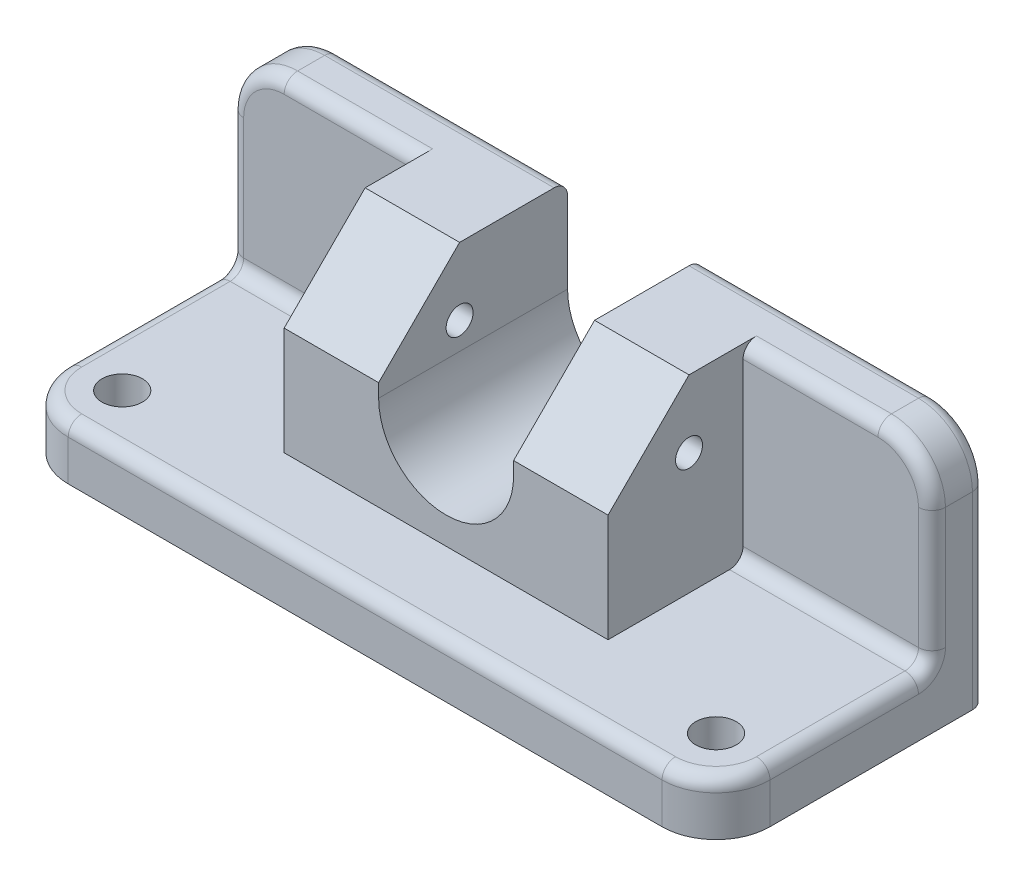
from build123d import *

# Parameters (mm, degrees)
SKETCH1_W                  = 130
SKETCH1_H                  = 100
BOSS_EXTRUDE1_DEPTH        = 20
SKETCH2_W                  = 130
SKETCH2_H                  = 20
BOSS_EXTRUDE2_DEPTH        = 70
FILLET1_R                  = 20
SKETCH3_W                  = 60
SKETCH3_H                  = 70
BOSS_EXTRUDE3_DEPTH        = 50
CUT_EXTRUDE1_DEPTH         = 132.244047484
CHAMFER1_SIZE              = 30
F_10_0_10_DIAMETER_HOLE1_D = 10
F_15_0_15_DIAMETER_HOLE1_D = 15
FILLET2_R                  = 5


with BuildPart() as part:
    # Sketch1 → Boss-Extrude1 (new body)
    with BuildSketch(Plane(origin=(0, 0, 0), x_dir=(1, 0, 0), z_dir=(0, 1, 0))):
        Rectangle(SKETCH1_W, SKETCH1_H)
    extrude(amount=BOSS_EXTRUDE1_DEPTH)

    # Sketch2 → Boss-Extrude2 (add)
    with BuildSketch(Plane(origin=(0, 20, 0), x_dir=(1, 0, 0), z_dir=(0, 1, 0))):
        with Locations((0, 40)):
            Rectangle(SKETCH2_W, SKETCH2_H)
    extrude(amount=BOSS_EXTRUDE2_DEPTH)

    # Fillet1
    fillet1_edges = [part.edges().sort_by_distance(p)[0] for p in [
        (-65, 10, 50),
        (-65, 90, -40),
    ]]
    fillet(fillet1_edges, radius=FILLET1_R)

    # Sketch3 → Boss-Extrude3 (add)
    with BuildSketch(Plane.XY.offset(-30)):
        with Locations((35, 55)):
            Rectangle(SKETCH3_W, SKETCH3_H)
    extrude(amount=BOSS_EXTRUDE3_DEPTH)

    # Sketch4 → Cut-Extrude1 (cut, through all)
    with BuildSketch(Plane.XY.offset(20)):
        with BuildLine():
            Line((40, 90), (40, 55))
            ThreePointArc((40, 55), (47.32233047, 37.32233047), (65, 30))
            Line((65, 30), (65, 90))
            Line((65, 90), (40, 90))
        make_face()
    extrude(amount=-CUT_EXTRUDE1_DEPTH, mode=Mode.SUBTRACT)

    # Chamfer1
    chamfer1_edges = [part.edges().sort_by_distance(p)[0] for p in [
        (22.5, 90, 20),
    ]]
    chamfer(chamfer1_edges, length=CHAMFER1_SIZE)

    # 10.0 _10_ Diameter Hole1 (through all)
    with Locations(Plane.ZY.offset(-5)):
        with Locations((-10, 65)):
            Hole(F_10_0_10_DIAMETER_HOLE1_D / 2)

    # 15.0 _15_ Diameter Hole1 (through all)
    with Locations(Plane(origin=(0, 20, 0), x_dir=(1, 0, 0), z_dir=(0, 1, 0))):
        with Locations((-45, -30)):
            Hole(F_15_0_15_DIAMETER_HOLE1_D / 2)

    # Fillet2
    fillet2_edges = [part.edges().sort_by_distance(p)[0] for p in [
        (-65, 20, 0),
        (10, 20, 50),
        (-65, 35, -50),
        (-2.5, 90, -50),
        (-20, 90, -30),
        (-65, 45, -30),
        (-59.142135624, 20, 44.142135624),
        (-59.142135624, 84.142135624, -50),
        (-59.142135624, 84.142135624, -30),
        (-30, 20, -30),
    ]]
    fillet(fillet2_edges, radius=FILLET2_R)

    # Mirror1: part across plane


with BuildPart() as part_1:
    add(part.part)
    add(part.part.mirror(Plane(origin=(65, 20, 50), x_dir=(0, 0, 1), z_dir=(-1, 0, 0))))


solid = part_1.part
